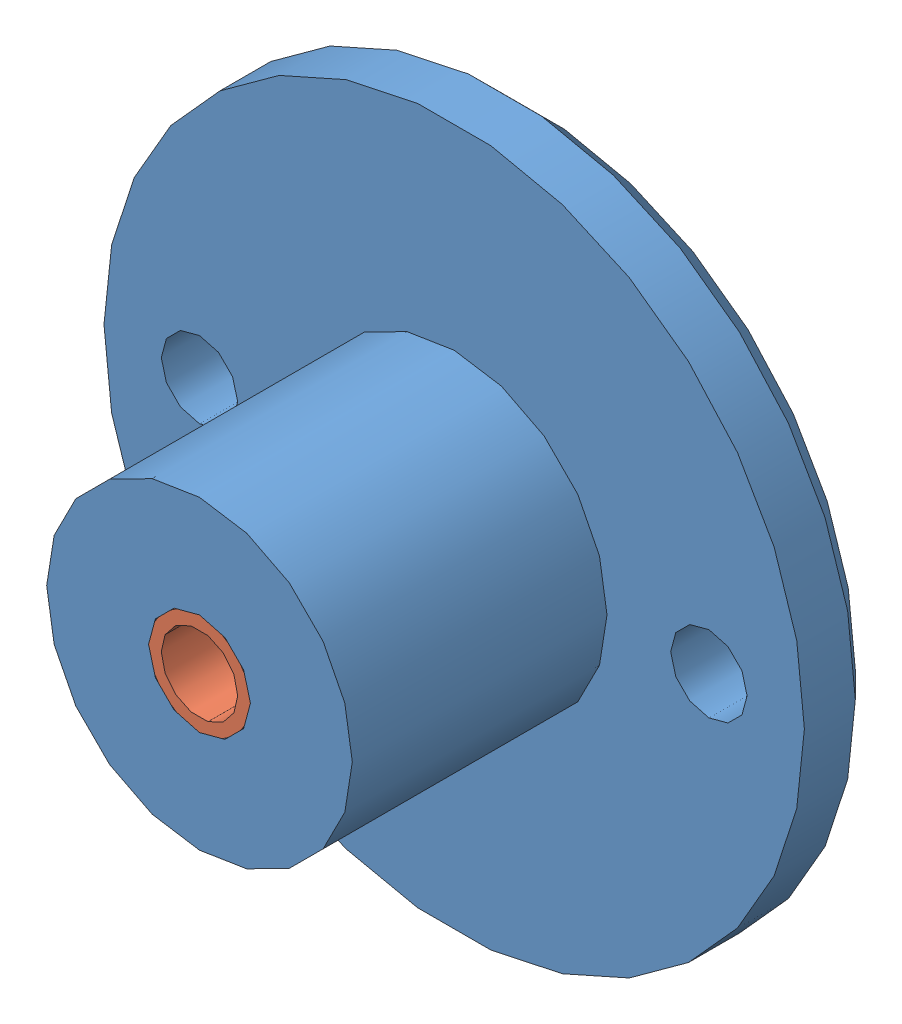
SolidWorks assembly MOTEUR STIRLING_91300.SLDASM, configuration Default (file format 10000). Lengths in mm.
Overall size (27.5 27.5 20).
2 component instances, 2 part files, 2 mates.
Components (placement in the parent):
- GUIDE DEPLACEUR-1: GUIDE DEPLACEUR.SLDPRT [Default] at (7.0432 15.5154 15.5176) size (27.5 27.5 13)
- TUBE GUIDE DEPLACEUR-1: TUBE GUIDE DEPLACEUR.SLDPRT [Default] at (7.0432 15.5154 8.5176) size (4 4 20)
Mates (geometry in assembly coordinates):
- Coaxiale1: concentric: cylinder of GUIDE DEPLACEUR-1 through (7.0432 15.5154 15.5176) axis (0 0 -1) radius 2; cylinder of TUBE GUIDE DEPLACEUR-1 through (7.0432 15.5154 28.5176) axis (0 0 -1) radius 2
- Coïncidente1: coincident aligned: plane of GUIDE DEPLACEUR-1 through (7.0432 15.5154 28.5176) normal (0 0 1); plane of TUBE GUIDE DEPLACEUR-1 through (7.0432 15.5154 28.5176) normal (0 0 1)
